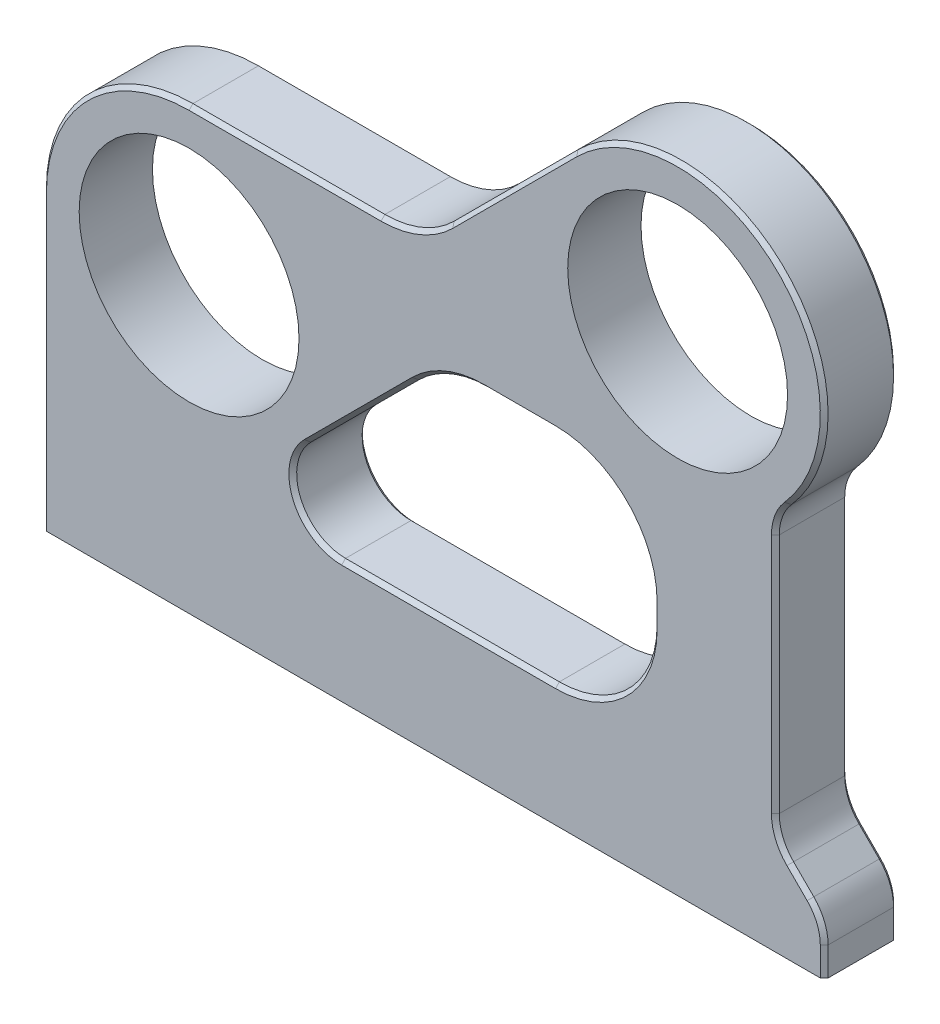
from build123d import *

# Parameters (mm, degrees)
SKETCH1_R                       = 14.2875
EXTRUDE1_DEPTH                  = 4.7625
F_8_32_TAPPED_HOLE1_D           = 3.4544
F_8_32_TAPPED_HOLE1_DEPTH       = 20.1676
F_8_32_TAPPED_HOLE1_CBORE_D     = 4.1656
F_8_32_TAPPED_HOLE1_CBORE_DEPTH = 17.78
F_8_32_TAPPED_HOLE1_TIP         = 1.037806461
SKETCH4_R                       = 2.38125
CUT_EXTRUDE1_DEPTH              = 12.7
CHAMFER1_SIZE                   = 0.508
CHAMFER2_SIZE                   = 0.508


with BuildPart() as part:
    # Sketch1 → Extrude1 (new, symmetric)
    with BuildSketch(Plane.XY):
        with BuildLine():
            Line((0, 19.05), (24.948719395, 19.05))
            ThreePointArc((24.948719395, 19.05), (29.808798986, 20.016729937), (33.928975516, 22.769743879))
            Line((33.928975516, 22.769743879), (50.029615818, 38.870384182))
            ThreePointArc((50.029615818, 38.870384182), (76.541788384, 39.285757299), (77.7875, 12.799609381))
            ThreePointArc((77.7875, 12.799609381), (76.610118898, 10.844543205), (76.2, 8.599479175))
            Line((76.2, 8.599479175), (76.2, -22.769743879))
            ThreePointArc((76.2, -22.769743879), (76.683364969, -25.199783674), (78.059871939, -27.259871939))
            Line((78.059871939, -27.259871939), (80.690128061, -29.890128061))
            ThreePointArc((80.690128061, -29.890128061), (82.066635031, -31.950216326), (82.55, -34.380256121))
            Line((82.55, -34.380256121), (82.55, -38.1))
            Line((82.55, -38.1), (-19.05, -38.1))
            Line((-19.05, -38.1), (-19.05, 0))
            ThreePointArc((-19.05, 0), (-13.470384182, 13.470384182), (0, 19.05))
        make_face()
        with Locations(Location((0, 0, 0), (0, 0, 180))):
            Circle(SKETCH1_R, mode=Mode.SUBTRACT)
        with Locations(Location((63.5, 25.4, 0), (0, 0, 180))):
            Circle(SKETCH1_R, mode=Mode.SUBTRACT)
        with BuildLine():
            Line((29.352868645, 2.630256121), (15.337740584, -11.384871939))
            ThreePointArc((15.337740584, -11.384871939), (13.961233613, -18.305039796), (19.827868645, -22.225))
            Line((19.827868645, -22.225), (47.625, -22.225))
            ThreePointArc((47.625, -22.225), (56.605256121, -18.505256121), (60.325, -9.525))
            Line((60.325, -9.525), (60.325, -6.35))
            ThreePointArc((60.325, -6.35), (56.605256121, 2.630256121), (47.625, 6.35))
            Line((47.625, 6.35), (38.333124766, 6.35))
            ThreePointArc((38.333124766, 6.35), (33.473045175, 5.383270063), (29.352868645, 2.630256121))
        make_face(mode=Mode.SUBTRACT)
    extrude(amount=EXTRUDE1_DEPTH, both=True)

    # 8-32 Tapped Hole1
    with Locations(Plane.XZ.offset(38.1)):
        with Locations((63.5, 0), (-12.7, 0)):
            CounterBoreHole(F_8_32_TAPPED_HOLE1_D / 2, F_8_32_TAPPED_HOLE1_CBORE_D / 2, F_8_32_TAPPED_HOLE1_CBORE_DEPTH, depth=F_8_32_TAPPED_HOLE1_DEPTH)
            with Locations((0, 0, -(F_8_32_TAPPED_HOLE1_DEPTH + F_8_32_TAPPED_HOLE1_TIP / 2))):  # 118° drill point
                Cone(0, F_8_32_TAPPED_HOLE1_D / 2, F_8_32_TAPPED_HOLE1_TIP, mode=Mode.SUBTRACT)

    # Sketch4 → Cut-Extrude1 (cut)
    with BuildSketch(Plane.XZ.offset(38.1)):
        Circle(SKETCH4_R)
        with Locations((50.8, 0)):
            Circle(SKETCH4_R)
    extrude(amount=-CUT_EXTRUDE1_DEPTH, mode=Mode.SUBTRACT)

    # Chamfer1
    chamfer1_edges = [part.edges().sort_by_distance(p)[0] for p in [
        (41.979295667, 30.82006403, 4.7625),
        (76.2, -7.085132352, -4.7625),
        (76.683364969, -25.199783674, -4.7625),
        (79.375, -28.575, -4.7625),
        (82.066635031, -31.950216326, -4.7625),
        (82.55, -36.240128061, -4.7625),
        (-19.05, -19.05, -4.7625),
        (29.808798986, 20.016729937, 4.7625),
        (-13.470384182, 13.470384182, -4.7625),
        (12.474359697, 19.05, -4.7625),
        (29.808798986, 20.016729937, -4.7625),
        (41.979295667, 30.82006403, -4.7625),
        (76.541788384, 39.285757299, -4.7625),
        (76.610118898, 10.844543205, -4.7625),
        (12.474359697, 19.05, 4.7625),
        (-13.470384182, 13.470384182, 4.7625),
        (-19.05, -19.05, 4.7625),
        (82.55, -36.240128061, 4.7625),
        (82.066635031, -31.950216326, 4.7625),
        (79.375, -28.575, 4.7625),
        (76.683364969, -25.199783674, 4.7625),
        (76.610118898, 10.844543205, 4.7625),
        (76.2, -7.085132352, 4.7625),
        (76.541788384, 39.285757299, 4.7625),
    ]]
    chamfer(chamfer1_edges, length=CHAMFER1_SIZE)

    # Chamfer2
    chamfer2_edges = [part.edges().sort_by_distance(p)[0] for p in [
        (13.961233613, -18.305039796, -4.7625),
        (33.726434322, -22.225, -4.7625),
        (56.605256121, -18.505256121, -4.7625),
        (60.325, -7.9375, -4.7625),
        (56.605256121, 2.630256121, -4.7625),
        (42.979062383, 6.35, -4.7625),
        (33.473045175, 5.383270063, -4.7625),
        (22.345304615, -4.377307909, -4.7625),
        (13.961233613, -18.305039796, 4.7625),
        (33.726434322, -22.225, 4.7625),
        (56.605256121, -18.505256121, 4.7625),
        (60.325, -7.9375, 4.7625),
        (56.605256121, 2.630256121, 4.7625),
        (42.979062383, 6.35, 4.7625),
        (33.473045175, 5.383270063, 4.7625),
        (22.345304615, -4.377307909, 4.7625),
    ]]
    chamfer(chamfer2_edges, length=CHAMFER2_SIZE)


solid = part.part
